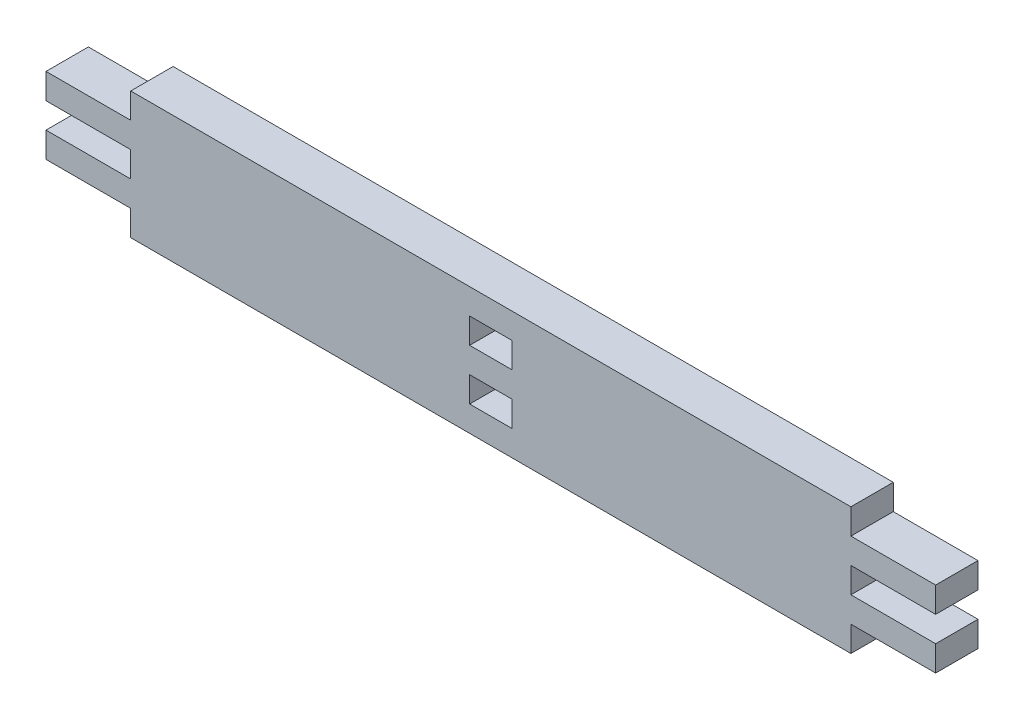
ISO-10303-21;
HEADER;
FILE_DESCRIPTION(('STEP AP214'),'2;1');
FILE_NAME('part.step','',(''),(''),'','','');
FILE_SCHEMA(('AUTOMOTIVE_DESIGN { 1 0 10303 214 1 1 1 1 }'));
ENDSEC;
DATA;
#1=APPLICATION_CONTEXT('core data for automotive mechanical design processes');
#2=APPLICATION_PROTOCOL_DEFINITION('international standard','automotive_design',2000,#1);
#3=PRODUCT_CONTEXT('',#1,'mechanical');
#4=PRODUCT('Part','Part','',(#3));
#5=PRODUCT_RELATED_PRODUCT_CATEGORY('part','',(#4));
#6=PRODUCT_DEFINITION_FORMATION('','',#4);
#7=PRODUCT_DEFINITION_CONTEXT('part definition',#1,'design');
#8=PRODUCT_DEFINITION('design','',#6,#7);
#9=PRODUCT_DEFINITION_SHAPE('','',#8);
#10=(LENGTH_UNIT() NAMED_UNIT(*) SI_UNIT(.MILLI.,.METRE.));
#11=(NAMED_UNIT(*) PLANE_ANGLE_UNIT() SI_UNIT($,.RADIAN.));
#12=(NAMED_UNIT(*) SI_UNIT($,.STERADIAN.) SOLID_ANGLE_UNIT());
#13=UNCERTAINTY_MEASURE_WITH_UNIT(LENGTH_MEASURE(1.E-05),#10,'distance_accuracy_value','');
#14=(GEOMETRIC_REPRESENTATION_CONTEXT(3) GLOBAL_UNCERTAINTY_ASSIGNED_CONTEXT((#13)) GLOBAL_UNIT_ASSIGNED_CONTEXT((#10,
#11,#12)) REPRESENTATION_CONTEXT('',''));
#15=CARTESIAN_POINT('',(0.,0.,0.));
#16=DIRECTION('',(0.,0.,1.));
#17=DIRECTION('',(1.,0.,0.));
#18=AXIS2_PLACEMENT_3D('',#15,#16,#17);
#19=CARTESIAN_POINT('',(31.5,-4.5,3.));
#20=DIRECTION('',(-1.,0.,0.));
#21=DIRECTION('',(0.,0.,1.));
#22=AXIS2_PLACEMENT_3D('',#19,#20,#21);
#23=PLANE('',#22);
#24=DIRECTION('',(0.,0.,1.));
#25=VECTOR('',#24,1.);
#26=CARTESIAN_POINT('',(31.5,-2.7,-7.));
#27=LINE('',#26,#25);
#28=CARTESIAN_POINT('',(31.5,-2.7,0.));
#29=VERTEX_POINT('',#28);
#30=CARTESIAN_POINT('',(31.5,-2.7,3.));
#31=VERTEX_POINT('',#30);
#32=EDGE_CURVE('E268',#29,#31,#27,.T.);
#33=ORIENTED_EDGE('',*,*,#32,.F.);
#34=DIRECTION('',(0.,1.,0.));
#35=VECTOR('',#34,1.);
#36=CARTESIAN_POINT('',(31.5,-4.5,0.));
#37=LINE('',#36,#35);
#38=CARTESIAN_POINT('',(31.5,-0.9,0.));
#39=VERTEX_POINT('',#38);
#40=EDGE_CURVE('E362',#29,#39,#37,.T.);
#41=ORIENTED_EDGE('',*,*,#40,.T.);
#42=DIRECTION('',(0.,0.,1.));
#43=VECTOR('',#42,1.);
#44=CARTESIAN_POINT('',(31.5,-0.9,-7.));
#45=LINE('',#44,#43);
#46=CARTESIAN_POINT('',(31.5,-0.9,3.));
#47=VERTEX_POINT('',#46);
#48=EDGE_CURVE('E285',#39,#47,#45,.T.);
#49=ORIENTED_EDGE('',*,*,#48,.T.);
#50=DIRECTION('',(0.,1.,0.));
#51=VECTOR('',#50,1.);
#52=CARTESIAN_POINT('',(31.5,-4.5,3.));
#53=LINE('',#52,#51);
#54=EDGE_CURVE('E349',#31,#47,#53,.T.);
#55=ORIENTED_EDGE('',*,*,#54,.F.);
#56=EDGE_LOOP('',(#33,#41,#49,#55));
#57=FACE_BOUND('',#56,.T.);
#58=ADVANCED_FACE('F31',(#57),#23,.F.);
#59=CARTESIAN_POINT('',(31.5,4.5,3.));
#60=DIRECTION('',(0.,0.,-1.));
#61=DIRECTION('',(-1.,0.,0.));
#62=AXIS2_PLACEMENT_3D('',#59,#60,#61);
#63=PLANE('',#62);
#64=DIRECTION('',(-1.,0.,0.));
#65=VECTOR('',#64,1.);
#66=CARTESIAN_POINT('',(1.50000000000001,-0.900000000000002,3.));
#67=LINE('',#66,#65);
#68=CARTESIAN_POINT('',(1.50000000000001,-0.900000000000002,3.));
#69=VERTEX_POINT('',#68);
#70=CARTESIAN_POINT('',(-1.49999999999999,-0.900000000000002,3.));
#71=VERTEX_POINT('',#70);
#72=EDGE_CURVE('E226',#69,#71,#67,.T.);
#73=ORIENTED_EDGE('',*,*,#72,.F.);
#74=DIRECTION('',(0.,1.,0.));
#75=VECTOR('',#74,1.);
#76=CARTESIAN_POINT('',(1.50000000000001,-0.900000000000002,3.));
#77=LINE('',#76,#75);
#78=CARTESIAN_POINT('',(1.50000000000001,-2.7,3.));
#79=VERTEX_POINT('',#78);
#80=EDGE_CURVE('E45',#79,#69,#77,.T.);
#81=ORIENTED_EDGE('',*,*,#80,.F.);
#82=DIRECTION('',(1.,0.,0.));
#83=VECTOR('',#82,1.);
#84=CARTESIAN_POINT('',(1.50000000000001,-2.7,3.));
#85=LINE('',#84,#83);
#86=CARTESIAN_POINT('',(-1.49999999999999,-2.7,3.));
#87=VERTEX_POINT('',#86);
#88=EDGE_CURVE('E233',#87,#79,#85,.T.);
#89=ORIENTED_EDGE('',*,*,#88,.F.);
#90=DIRECTION('',(0.,-1.,0.));
#91=VECTOR('',#90,1.);
#92=CARTESIAN_POINT('',(-1.49999999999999,-0.900000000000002,3.));
#93=LINE('',#92,#91);
#94=EDGE_CURVE('E217',#71,#87,#93,.T.);
#95=ORIENTED_EDGE('',*,*,#94,.F.);
#96=EDGE_LOOP('',(#73,#81,#89,#95));
#97=FACE_BOUND('',#96,.T.);
#98=DIRECTION('',(1.,0.,0.));
#99=VECTOR('',#98,1.);
#100=CARTESIAN_POINT('',(-1.49999999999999,0.899999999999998,3.));
#101=LINE('',#100,#99);
#102=CARTESIAN_POINT('',(-1.49999999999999,0.899999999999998,3.));
#103=VERTEX_POINT('',#102);
#104=CARTESIAN_POINT('',(1.50000000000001,0.899999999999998,3.));
#105=VERTEX_POINT('',#104);
#106=EDGE_CURVE('E244',#103,#105,#101,.T.);
#107=ORIENTED_EDGE('',*,*,#106,.F.);
#108=DIRECTION('',(0.,-1.,0.));
#109=VECTOR('',#108,1.);
#110=CARTESIAN_POINT('',(-1.49999999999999,2.7,3.));
#111=LINE('',#110,#109);
#112=CARTESIAN_POINT('',(-1.49999999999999,2.7,3.));
#113=VERTEX_POINT('',#112);
#114=EDGE_CURVE('E240',#113,#103,#111,.T.);
#115=ORIENTED_EDGE('',*,*,#114,.F.);
#116=DIRECTION('',(-1.,0.,0.));
#117=VECTOR('',#116,1.);
#118=CARTESIAN_POINT('',(-1.49999999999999,2.7,3.));
#119=LINE('',#118,#117);
#120=CARTESIAN_POINT('',(1.50000000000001,2.7,3.));
#121=VERTEX_POINT('',#120);
#122=EDGE_CURVE('E250',#121,#113,#119,.T.);
#123=ORIENTED_EDGE('',*,*,#122,.F.);
#124=DIRECTION('',(0.,1.,0.));
#125=VECTOR('',#124,1.);
#126=CARTESIAN_POINT('',(1.50000000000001,2.7,3.));
#127=LINE('',#126,#125);
#128=EDGE_CURVE('E247',#105,#121,#127,.T.);
#129=ORIENTED_EDGE('',*,*,#128,.F.);
#130=EDGE_LOOP('',(#107,#115,#123,#129));
#131=FACE_BOUND('',#130,.T.);
#132=DIRECTION('',(0.,1.,0.));
#133=VECTOR('',#132,1.);
#134=CARTESIAN_POINT('',(25.5,-2.7,3.));
#135=LINE('',#134,#133);
#136=CARTESIAN_POINT('',(25.5,-4.5,3.));
#137=VERTEX_POINT('',#136);
#138=CARTESIAN_POINT('',(25.5,-2.7,3.));
#139=VERTEX_POINT('',#138);
#140=EDGE_CURVE('E265',#137,#139,#135,.T.);
#141=ORIENTED_EDGE('',*,*,#140,.T.);
#142=DIRECTION('',(1.,0.,0.));
#143=VECTOR('',#142,1.);
#144=CARTESIAN_POINT('',(31.5,-2.7,3.));
#145=LINE('',#144,#143);
#146=EDGE_CURVE('E256',#139,#31,#145,.T.);
#147=ORIENTED_EDGE('',*,*,#146,.T.);
#148=ORIENTED_EDGE('',*,*,#54,.T.);
#149=DIRECTION('',(-1.,0.,0.));
#150=VECTOR('',#149,1.);
#151=CARTESIAN_POINT('',(31.5,-0.9,3.));
#152=LINE('',#151,#150);
#153=CARTESIAN_POINT('',(25.5,-0.9,3.));
#154=VERTEX_POINT('',#153);
#155=EDGE_CURVE('E281',#47,#154,#152,.T.);
#156=ORIENTED_EDGE('',*,*,#155,.T.);
#157=DIRECTION('',(0.,1.,0.));
#158=VECTOR('',#157,1.);
#159=CARTESIAN_POINT('',(25.5,0.9,3.));
#160=LINE('',#159,#158);
#161=CARTESIAN_POINT('',(25.5,0.9,3.));
#162=VERTEX_POINT('',#161);
#163=EDGE_CURVE('E278',#154,#162,#160,.T.);
#164=ORIENTED_EDGE('',*,*,#163,.T.);
#165=DIRECTION('',(1.,0.,0.));
#166=VECTOR('',#165,1.);
#167=CARTESIAN_POINT('',(31.5,0.9,3.));
#168=LINE('',#167,#166);
#169=CARTESIAN_POINT('',(31.5,0.9,3.));
#170=VERTEX_POINT('',#169);
#171=EDGE_CURVE('E275',#162,#170,#168,.T.);
#172=ORIENTED_EDGE('',*,*,#171,.T.);
#173=CARTESIAN_POINT('',(31.5,2.7,3.));
#174=VERTEX_POINT('',#173);
#175=EDGE_CURVE('E352',#170,#174,#53,.T.);
#176=ORIENTED_EDGE('',*,*,#175,.T.);
#177=DIRECTION('',(-1.,0.,0.));
#178=VECTOR('',#177,1.);
#179=CARTESIAN_POINT('',(31.5,2.7,3.));
#180=LINE('',#179,#178);
#181=CARTESIAN_POINT('',(25.5,2.7,3.));
#182=VERTEX_POINT('',#181);
#183=EDGE_CURVE('E296',#174,#182,#180,.T.);
#184=ORIENTED_EDGE('',*,*,#183,.T.);
#185=DIRECTION('',(0.,1.,0.));
#186=VECTOR('',#185,1.);
#187=CARTESIAN_POINT('',(25.5,4.5,3.));
#188=LINE('',#187,#186);
#189=CARTESIAN_POINT('',(25.5,4.5,3.));
#190=VERTEX_POINT('',#189);
#191=EDGE_CURVE('E288',#182,#190,#188,.T.);
#192=ORIENTED_EDGE('',*,*,#191,.T.);
#193=DIRECTION('',(-1.,0.,0.));
#194=VECTOR('',#193,1.);
#195=CARTESIAN_POINT('',(-31.5,4.5,3.));
#196=LINE('',#195,#194);
#197=CARTESIAN_POINT('',(-25.5,4.5,3.));
#198=VERTEX_POINT('',#197);
#199=EDGE_CURVE('E351',#190,#198,#196,.T.);
#200=ORIENTED_EDGE('',*,*,#199,.T.);
#201=DIRECTION('',(0.,1.,0.));
#202=VECTOR('',#201,1.);
#203=CARTESIAN_POINT('',(-25.5,4.5,3.));
#204=LINE('',#203,#202);
#205=CARTESIAN_POINT('',(-25.5,2.7,3.));
#206=VERTEX_POINT('',#205);
#207=EDGE_CURVE('E338',#206,#198,#204,.T.);
#208=ORIENTED_EDGE('',*,*,#207,.F.);
#209=DIRECTION('',(1.,0.,0.));
#210=VECTOR('',#209,1.);
#211=CARTESIAN_POINT('',(-31.5,2.7,3.));
#212=LINE('',#211,#210);
#213=CARTESIAN_POINT('',(-31.5,2.7,3.));
#214=VERTEX_POINT('',#213);
#215=EDGE_CURVE('E330',#214,#206,#212,.T.);
#216=ORIENTED_EDGE('',*,*,#215,.F.);
#217=DIRECTION('',(0.,-1.,0.));
#218=VECTOR('',#217,1.);
#219=CARTESIAN_POINT('',(-31.5,-4.5,3.));
#220=LINE('',#219,#218);
#221=CARTESIAN_POINT('',(-31.5,0.9,3.));
#222=VERTEX_POINT('',#221);
#223=EDGE_CURVE('E355',#214,#222,#220,.T.);
#224=ORIENTED_EDGE('',*,*,#223,.T.);
#225=DIRECTION('',(-1.,0.,0.));
#226=VECTOR('',#225,1.);
#227=CARTESIAN_POINT('',(-31.5,0.9,3.));
#228=LINE('',#227,#226);
#229=CARTESIAN_POINT('',(-25.5,0.9,3.));
#230=VERTEX_POINT('',#229);
#231=EDGE_CURVE('E324',#230,#222,#228,.T.);
#232=ORIENTED_EDGE('',*,*,#231,.F.);
#233=DIRECTION('',(0.,1.,0.));
#234=VECTOR('',#233,1.);
#235=CARTESIAN_POINT('',(-25.5,0.9,3.));
#236=LINE('',#235,#234);
#237=CARTESIAN_POINT('',(-25.5,-0.9,3.));
#238=VERTEX_POINT('',#237);
#239=EDGE_CURVE('E321',#238,#230,#236,.T.);
#240=ORIENTED_EDGE('',*,*,#239,.F.);
#241=DIRECTION('',(1.,0.,0.));
#242=VECTOR('',#241,1.);
#243=CARTESIAN_POINT('',(-31.5,-0.9,3.));
#244=LINE('',#243,#242);
#245=CARTESIAN_POINT('',(-31.5,-0.9,3.));
#246=VERTEX_POINT('',#245);
#247=EDGE_CURVE('E315',#246,#238,#244,.T.);
#248=ORIENTED_EDGE('',*,*,#247,.F.);
#249=CARTESIAN_POINT('',(-31.5,-2.7,3.));
#250=VERTEX_POINT('',#249);
#251=EDGE_CURVE('E354',#246,#250,#220,.T.);
#252=ORIENTED_EDGE('',*,*,#251,.T.);
#253=DIRECTION('',(-1.,0.,0.));
#254=VECTOR('',#253,1.);
#255=CARTESIAN_POINT('',(-31.5,-2.7,3.));
#256=LINE('',#255,#254);
#257=CARTESIAN_POINT('',(-25.5,-2.7,3.));
#258=VERTEX_POINT('',#257);
#259=EDGE_CURVE('E309',#258,#250,#256,.T.);
#260=ORIENTED_EDGE('',*,*,#259,.F.);
#261=DIRECTION('',(0.,1.,0.));
#262=VECTOR('',#261,1.);
#263=CARTESIAN_POINT('',(-25.5,-2.7,3.));
#264=LINE('',#263,#262);
#265=CARTESIAN_POINT('',(-25.5,-4.5,3.));
#266=VERTEX_POINT('',#265);
#267=EDGE_CURVE('E303',#266,#258,#264,.T.);
#268=ORIENTED_EDGE('',*,*,#267,.F.);
#269=DIRECTION('',(1.,0.,0.));
#270=VECTOR('',#269,1.);
#271=CARTESIAN_POINT('',(-31.5,-4.5,3.));
#272=LINE('',#271,#270);
#273=EDGE_CURVE('E358',#266,#137,#272,.T.);
#274=ORIENTED_EDGE('',*,*,#273,.T.);
#275=EDGE_LOOP('',(#141,#147,#148,#156,#164,#172,#176,#184,#192,#200,#208,#216,#224,#232,#240,
#248,#252,#260,#268,#274));
#276=FACE_BOUND('',#275,.T.);
#277=ADVANCED_FACE('F230',(#97,#131,#276),#63,.F.);
#278=CARTESIAN_POINT('',(31.5,4.5,0.));
#279=DIRECTION('',(0.,0.,-1.));
#280=DIRECTION('',(-1.,0.,0.));
#281=AXIS2_PLACEMENT_3D('',#278,#279,#280);
#282=PLANE('',#281);
#283=DIRECTION('',(0.,-1.,0.));
#284=VECTOR('',#283,1.);
#285=CARTESIAN_POINT('',(1.50000000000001,4.5,0.));
#286=LINE('',#285,#284);
#287=CARTESIAN_POINT('',(1.50000000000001,-0.900000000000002,0.));
#288=VERTEX_POINT('',#287);
#289=CARTESIAN_POINT('',(1.50000000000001,-2.7,0.));
#290=VERTEX_POINT('',#289);
#291=EDGE_CURVE('E11',#288,#290,#286,.T.);
#292=ORIENTED_EDGE('',*,*,#291,.F.);
#293=DIRECTION('',(1.,0.,0.));
#294=VECTOR('',#293,1.);
#295=CARTESIAN_POINT('',(31.5,-0.900000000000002,0.));
#296=LINE('',#295,#294);
#297=CARTESIAN_POINT('',(-1.49999999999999,-0.900000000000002,0.));
#298=VERTEX_POINT('',#297);
#299=EDGE_CURVE('E418',#298,#288,#296,.T.);
#300=ORIENTED_EDGE('',*,*,#299,.F.);
#301=DIRECTION('',(0.,1.,0.));
#302=VECTOR('',#301,1.);
#303=CARTESIAN_POINT('',(-1.49999999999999,4.5,0.));
#304=LINE('',#303,#302);
#305=CARTESIAN_POINT('',(-1.49999999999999,-2.7,0.));
#306=VERTEX_POINT('',#305);
#307=EDGE_CURVE('E220',#306,#298,#304,.T.);
#308=ORIENTED_EDGE('',*,*,#307,.F.);
#309=DIRECTION('',(-1.,0.,0.));
#310=VECTOR('',#309,1.);
#311=CARTESIAN_POINT('',(31.5,-2.7,0.));
#312=LINE('',#311,#310);
#313=EDGE_CURVE('E38',#290,#306,#312,.T.);
#314=ORIENTED_EDGE('',*,*,#313,.F.);
#315=EDGE_LOOP('',(#292,#300,#308,#314));
#316=FACE_BOUND('',#315,.T.);
#317=DIRECTION('',(0.,1.,0.));
#318=VECTOR('',#317,1.);
#319=CARTESIAN_POINT('',(-1.49999999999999,4.5,0.));
#320=LINE('',#319,#318);
#321=CARTESIAN_POINT('',(-1.49999999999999,0.899999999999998,0.));
#322=VERTEX_POINT('',#321);
#323=CARTESIAN_POINT('',(-1.49999999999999,2.7,0.));
#324=VERTEX_POINT('',#323);
#325=EDGE_CURVE('E416',#322,#324,#320,.T.);
#326=ORIENTED_EDGE('',*,*,#325,.F.);
#327=DIRECTION('',(-1.,0.,0.));
#328=VECTOR('',#327,1.);
#329=CARTESIAN_POINT('',(31.5,0.899999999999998,0.));
#330=LINE('',#329,#328);
#331=CARTESIAN_POINT('',(1.50000000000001,0.899999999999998,0.));
#332=VERTEX_POINT('',#331);
#333=EDGE_CURVE('E409',#332,#322,#330,.T.);
#334=ORIENTED_EDGE('',*,*,#333,.F.);
#335=DIRECTION('',(0.,-1.,0.));
#336=VECTOR('',#335,1.);
#337=CARTESIAN_POINT('',(1.50000000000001,4.5,0.));
#338=LINE('',#337,#336);
#339=CARTESIAN_POINT('',(1.50000000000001,2.7,0.));
#340=VERTEX_POINT('',#339);
#341=EDGE_CURVE('E411',#340,#332,#338,.T.);
#342=ORIENTED_EDGE('',*,*,#341,.F.);
#343=DIRECTION('',(1.,0.,0.));
#344=VECTOR('',#343,1.);
#345=CARTESIAN_POINT('',(31.5,2.7,0.));
#346=LINE('',#345,#344);
#347=EDGE_CURVE('E414',#324,#340,#346,.T.);
#348=ORIENTED_EDGE('',*,*,#347,.F.);
#349=EDGE_LOOP('',(#326,#334,#342,#348));
#350=FACE_BOUND('',#349,.T.);
#351=DIRECTION('',(-1.,0.,0.));
#352=VECTOR('',#351,1.);
#353=CARTESIAN_POINT('',(31.5,-2.7,0.));
#354=LINE('',#353,#352);
#355=CARTESIAN_POINT('',(25.5,-2.7,0.));
#356=VERTEX_POINT('',#355);
#357=EDGE_CURVE('E406',#29,#356,#354,.T.);
#358=ORIENTED_EDGE('',*,*,#357,.T.);
#359=DIRECTION('',(0.,-1.,0.));
#360=VECTOR('',#359,1.);
#361=CARTESIAN_POINT('',(25.5,4.5,0.));
#362=LINE('',#361,#360);
#363=CARTESIAN_POINT('',(25.5,-4.5,0.));
#364=VERTEX_POINT('',#363);
#365=EDGE_CURVE('E271',#356,#364,#362,.T.);
#366=ORIENTED_EDGE('',*,*,#365,.T.);
#367=DIRECTION('',(1.,0.,0.));
#368=VECTOR('',#367,1.);
#369=CARTESIAN_POINT('',(-31.5,-4.5,0.));
#370=LINE('',#369,#368);
#371=CARTESIAN_POINT('',(-25.5,-4.5,0.));
#372=VERTEX_POINT('',#371);
#373=EDGE_CURVE('E370',#372,#364,#370,.T.);
#374=ORIENTED_EDGE('',*,*,#373,.F.);
#375=DIRECTION('',(0.,-1.,0.));
#376=VECTOR('',#375,1.);
#377=CARTESIAN_POINT('',(-25.5,4.5,0.));
#378=LINE('',#377,#376);
#379=CARTESIAN_POINT('',(-25.5,-2.7,0.));
#380=VERTEX_POINT('',#379);
#381=EDGE_CURVE('E384',#380,#372,#378,.T.);
#382=ORIENTED_EDGE('',*,*,#381,.F.);
#383=DIRECTION('',(1.,0.,0.));
#384=VECTOR('',#383,1.);
#385=CARTESIAN_POINT('',(31.5,-2.7,0.));
#386=LINE('',#385,#384);
#387=CARTESIAN_POINT('',(-31.5,-2.7,0.));
#388=VERTEX_POINT('',#387);
#389=EDGE_CURVE('E386',#388,#380,#386,.T.);
#390=ORIENTED_EDGE('',*,*,#389,.F.);
#391=DIRECTION('',(0.,-1.,0.));
#392=VECTOR('',#391,1.);
#393=CARTESIAN_POINT('',(-31.5,-4.5,0.));
#394=LINE('',#393,#392);
#395=CARTESIAN_POINT('',(-31.5,-0.9,0.));
#396=VERTEX_POINT('',#395);
#397=EDGE_CURVE('E366',#396,#388,#394,.T.);
#398=ORIENTED_EDGE('',*,*,#397,.F.);
#399=DIRECTION('',(-1.,0.,0.));
#400=VECTOR('',#399,1.);
#401=CARTESIAN_POINT('',(31.5,-0.900000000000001,0.));
#402=LINE('',#401,#400);
#403=CARTESIAN_POINT('',(-25.5,-0.900000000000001,0.));
#404=VERTEX_POINT('',#403);
#405=EDGE_CURVE('E377',#404,#396,#402,.T.);
#406=ORIENTED_EDGE('',*,*,#405,.F.);
#407=DIRECTION('',(0.,-1.,0.));
#408=VECTOR('',#407,1.);
#409=CARTESIAN_POINT('',(-25.5,4.5,0.));
#410=LINE('',#409,#408);
#411=CARTESIAN_POINT('',(-25.5,0.9,0.));
#412=VERTEX_POINT('',#411);
#413=EDGE_CURVE('E379',#412,#404,#410,.T.);
#414=ORIENTED_EDGE('',*,*,#413,.F.);
#415=DIRECTION('',(1.,0.,0.));
#416=VECTOR('',#415,1.);
#417=CARTESIAN_POINT('',(31.5,0.9,0.));
#418=LINE('',#417,#416);
#419=CARTESIAN_POINT('',(-31.5,0.9,0.));
#420=VERTEX_POINT('',#419);
#421=EDGE_CURVE('E382',#420,#412,#418,.T.);
#422=ORIENTED_EDGE('',*,*,#421,.F.);
#423=CARTESIAN_POINT('',(-31.5,2.7,0.));
#424=VERTEX_POINT('',#423);
#425=EDGE_CURVE('E367',#424,#420,#394,.T.);
#426=ORIENTED_EDGE('',*,*,#425,.F.);
#427=DIRECTION('',(-1.,0.,0.));
#428=VECTOR('',#427,1.);
#429=CARTESIAN_POINT('',(31.5,2.7,0.));
#430=LINE('',#429,#428);
#431=CARTESIAN_POINT('',(-25.5,2.7,0.));
#432=VERTEX_POINT('',#431);
#433=EDGE_CURVE('E361',#432,#424,#430,.T.);
#434=ORIENTED_EDGE('',*,*,#433,.F.);
#435=DIRECTION('',(0.,-1.,0.));
#436=VECTOR('',#435,1.);
#437=CARTESIAN_POINT('',(-25.5,4.5,0.));
#438=LINE('',#437,#436);
#439=CARTESIAN_POINT('',(-25.5,4.5,0.));
#440=VERTEX_POINT('',#439);
#441=EDGE_CURVE('E374',#440,#432,#438,.T.);
#442=ORIENTED_EDGE('',*,*,#441,.F.);
#443=DIRECTION('',(-1.,0.,0.));
#444=VECTOR('',#443,1.);
#445=CARTESIAN_POINT('',(-31.5,4.5,0.));
#446=LINE('',#445,#444);
#447=CARTESIAN_POINT('',(25.5,4.5,0.));
#448=VERTEX_POINT('',#447);
#449=EDGE_CURVE('E364',#448,#440,#446,.T.);
#450=ORIENTED_EDGE('',*,*,#449,.F.);
#451=DIRECTION('',(0.,-1.,0.));
#452=VECTOR('',#451,1.);
#453=CARTESIAN_POINT('',(25.5,4.5,0.));
#454=LINE('',#453,#452);
#455=CARTESIAN_POINT('',(25.5,2.7,0.));
#456=VERTEX_POINT('',#455);
#457=EDGE_CURVE('E389',#448,#456,#454,.T.);
#458=ORIENTED_EDGE('',*,*,#457,.T.);
#459=DIRECTION('',(1.,0.,0.));
#460=VECTOR('',#459,1.);
#461=CARTESIAN_POINT('',(31.5,2.7,0.));
#462=LINE('',#461,#460);
#463=CARTESIAN_POINT('',(31.5,2.7,0.));
#464=VERTEX_POINT('',#463);
#465=EDGE_CURVE('E392',#456,#464,#462,.T.);
#466=ORIENTED_EDGE('',*,*,#465,.T.);
#467=CARTESIAN_POINT('',(31.5,0.9,0.));
#468=VERTEX_POINT('',#467);
#469=EDGE_CURVE('E345',#468,#464,#37,.T.);
#470=ORIENTED_EDGE('',*,*,#469,.F.);
#471=DIRECTION('',(-1.,0.,0.));
#472=VECTOR('',#471,1.);
#473=CARTESIAN_POINT('',(31.5,0.9,0.));
#474=LINE('',#473,#472);
#475=CARTESIAN_POINT('',(25.5,0.9,0.));
#476=VERTEX_POINT('',#475);
#477=EDGE_CURVE('E395',#468,#476,#474,.T.);
#478=ORIENTED_EDGE('',*,*,#477,.T.);
#479=DIRECTION('',(0.,-1.,0.));
#480=VECTOR('',#479,1.);
#481=CARTESIAN_POINT('',(25.5,4.5,0.));
#482=LINE('',#481,#480);
#483=CARTESIAN_POINT('',(25.5,-0.9,0.));
#484=VERTEX_POINT('',#483);
#485=EDGE_CURVE('E398',#476,#484,#482,.T.);
#486=ORIENTED_EDGE('',*,*,#485,.T.);
#487=DIRECTION('',(1.,0.,0.));
#488=VECTOR('',#487,1.);
#489=CARTESIAN_POINT('',(31.5,-0.900000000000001,0.));
#490=LINE('',#489,#488);
#491=EDGE_CURVE('E401',#484,#39,#490,.T.);
#492=ORIENTED_EDGE('',*,*,#491,.T.);
#493=ORIENTED_EDGE('',*,*,#40,.F.);
#494=EDGE_LOOP('',(#358,#366,#374,#382,#390,#398,#406,#414,#422,#426,#434,#442,#450,#458,#466,
#470,#478,#486,#492,#493));
#495=FACE_BOUND('',#494,.T.);
#496=ADVANCED_FACE('F426',(#316,#350,#495),#282,.T.);
#497=CARTESIAN_POINT('',(-31.5,-4.5,3.));
#498=DIRECTION('',(0.,1.,0.));
#499=DIRECTION('',(0.,0.,1.));
#500=AXIS2_PLACEMENT_3D('',#497,#498,#499);
#501=PLANE('',#500);
#502=DIRECTION('',(0.,0.,-1.));
#503=VECTOR('',#502,1.);
#504=CARTESIAN_POINT('',(25.5,-4.5,3.));
#505=LINE('',#504,#503);
#506=EDGE_CURVE('E404',#137,#364,#505,.T.);
#507=ORIENTED_EDGE('',*,*,#506,.F.);
#508=ORIENTED_EDGE('',*,*,#273,.F.);
#509=DIRECTION('',(0.,0.,1.));
#510=VECTOR('',#509,1.);
#511=CARTESIAN_POINT('',(-25.5,-4.5,-7.));
#512=LINE('',#511,#510);
#513=EDGE_CURVE('E311',#372,#266,#512,.T.);
#514=ORIENTED_EDGE('',*,*,#513,.F.);
#515=ORIENTED_EDGE('',*,*,#373,.T.);
#516=EDGE_LOOP('',(#507,#508,#514,#515));
#517=FACE_BOUND('',#516,.T.);
#518=ADVANCED_FACE('F454',(#517),#501,.F.);
#519=DIRECTION('',(0.,0.,1.));
#520=VECTOR('',#519,1.);
#521=CARTESIAN_POINT('',(31.5,0.9,-7.));
#522=LINE('',#521,#520);
#523=EDGE_CURVE('E284',#468,#170,#522,.T.);
#524=ORIENTED_EDGE('',*,*,#523,.F.);
#525=ORIENTED_EDGE('',*,*,#469,.T.);
#526=DIRECTION('',(0.,0.,1.));
#527=VECTOR('',#526,1.);
#528=CARTESIAN_POINT('',(31.5,2.7,-7.));
#529=LINE('',#528,#527);
#530=EDGE_CURVE('E300',#464,#174,#529,.T.);
#531=ORIENTED_EDGE('',*,*,#530,.T.);
#532=ORIENTED_EDGE('',*,*,#175,.F.);
#533=EDGE_LOOP('',(#524,#525,#531,#532));
#534=FACE_BOUND('',#533,.T.);
#535=ADVANCED_FACE('F444',(#534),#23,.F.);
#536=CARTESIAN_POINT('',(-31.5,4.5,3.));
#537=DIRECTION('',(0.,-1.,0.));
#538=DIRECTION('',(0.,0.,-1.));
#539=AXIS2_PLACEMENT_3D('',#536,#537,#538);
#540=PLANE('',#539);
#541=DIRECTION('',(0.,0.,1.));
#542=VECTOR('',#541,1.);
#543=CARTESIAN_POINT('',(25.5,4.5,-7.));
#544=LINE('',#543,#542);
#545=EDGE_CURVE('E299',#448,#190,#544,.T.);
#546=ORIENTED_EDGE('',*,*,#545,.F.);
#547=ORIENTED_EDGE('',*,*,#449,.T.);
#548=DIRECTION('',(0.,0.,1.));
#549=VECTOR('',#548,1.);
#550=CARTESIAN_POINT('',(-25.5,4.5,-7.));
#551=LINE('',#550,#549);
#552=EDGE_CURVE('E342',#440,#198,#551,.T.);
#553=ORIENTED_EDGE('',*,*,#552,.T.);
#554=ORIENTED_EDGE('',*,*,#199,.F.);
#555=EDGE_LOOP('',(#546,#547,#553,#554));
#556=FACE_BOUND('',#555,.T.);
#557=ADVANCED_FACE('F453',(#556),#540,.F.);
#558=CARTESIAN_POINT('',(-31.5,-4.5,3.));
#559=DIRECTION('',(1.,0.,0.));
#560=DIRECTION('',(0.,0.,-1.));
#561=AXIS2_PLACEMENT_3D('',#558,#559,#560);
#562=PLANE('',#561);
#563=ORIENTED_EDGE('',*,*,#425,.T.);
#564=DIRECTION('',(0.,0.,1.));
#565=VECTOR('',#564,1.);
#566=CARTESIAN_POINT('',(-31.5,0.9,-7.));
#567=LINE('',#566,#565);
#568=EDGE_CURVE('E327',#420,#222,#567,.T.);
#569=ORIENTED_EDGE('',*,*,#568,.T.);
#570=ORIENTED_EDGE('',*,*,#223,.F.);
#571=DIRECTION('',(0.,0.,1.));
#572=VECTOR('',#571,1.);
#573=CARTESIAN_POINT('',(-31.5,2.7,-7.));
#574=LINE('',#573,#572);
#575=EDGE_CURVE('E341',#424,#214,#574,.T.);
#576=ORIENTED_EDGE('',*,*,#575,.F.);
#577=EDGE_LOOP('',(#563,#569,#570,#576));
#578=FACE_BOUND('',#577,.T.);
#579=ADVANCED_FACE('F459',(#578),#562,.F.);
#580=ORIENTED_EDGE('',*,*,#397,.T.);
#581=DIRECTION('',(0.,0.,1.));
#582=VECTOR('',#581,1.);
#583=CARTESIAN_POINT('',(-31.5,-2.7,-7.));
#584=LINE('',#583,#582);
#585=EDGE_CURVE('E312',#388,#250,#584,.T.);
#586=ORIENTED_EDGE('',*,*,#585,.T.);
#587=ORIENTED_EDGE('',*,*,#251,.F.);
#588=DIRECTION('',(0.,0.,1.));
#589=VECTOR('',#588,1.);
#590=CARTESIAN_POINT('',(-31.5,-0.9,-7.));
#591=LINE('',#590,#589);
#592=EDGE_CURVE('E326',#396,#246,#591,.T.);
#593=ORIENTED_EDGE('',*,*,#592,.F.);
#594=EDGE_LOOP('',(#580,#586,#587,#593));
#595=FACE_BOUND('',#594,.T.);
#596=ADVANCED_FACE('F513',(#595),#562,.F.);
#597=CARTESIAN_POINT('',(-25.5,4.5,-7.));
#598=DIRECTION('',(1.,0.,0.));
#599=DIRECTION('',(0.,0.,-1.));
#600=AXIS2_PLACEMENT_3D('',#597,#598,#599);
#601=PLANE('',#600);
#602=ORIENTED_EDGE('',*,*,#441,.T.);
#603=DIRECTION('',(0.,0.,1.));
#604=VECTOR('',#603,1.);
#605=CARTESIAN_POINT('',(-25.5,2.7,-7.));
#606=LINE('',#605,#604);
#607=EDGE_CURVE('E346',#432,#206,#606,.T.);
#608=ORIENTED_EDGE('',*,*,#607,.T.);
#609=ORIENTED_EDGE('',*,*,#207,.T.);
#610=ORIENTED_EDGE('',*,*,#552,.F.);
#611=EDGE_LOOP('',(#602,#608,#609,#610));
#612=FACE_BOUND('',#611,.T.);
#613=ADVANCED_FACE('F540',(#612),#601,.F.);
#614=CARTESIAN_POINT('',(-31.5,2.7,-7.));
#615=DIRECTION('',(0.,-1.,0.));
#616=DIRECTION('',(0.,0.,-1.));
#617=AXIS2_PLACEMENT_3D('',#614,#615,#616);
#618=PLANE('',#617);
#619=ORIENTED_EDGE('',*,*,#433,.T.);
#620=ORIENTED_EDGE('',*,*,#575,.T.);
#621=ORIENTED_EDGE('',*,*,#215,.T.);
#622=ORIENTED_EDGE('',*,*,#607,.F.);
#623=EDGE_LOOP('',(#619,#620,#621,#622));
#624=FACE_BOUND('',#623,.T.);
#625=ADVANCED_FACE('F535',(#624),#618,.F.);
#626=CARTESIAN_POINT('',(-31.5,0.9,-7.));
#627=DIRECTION('',(0.,1.,0.));
#628=DIRECTION('',(0.,0.,1.));
#629=AXIS2_PLACEMENT_3D('',#626,#627,#628);
#630=PLANE('',#629);
#631=ORIENTED_EDGE('',*,*,#421,.T.);
#632=DIRECTION('',(0.,0.,1.));
#633=VECTOR('',#632,1.);
#634=CARTESIAN_POINT('',(-25.5,0.9,-7.));
#635=LINE('',#634,#633);
#636=EDGE_CURVE('E331',#412,#230,#635,.T.);
#637=ORIENTED_EDGE('',*,*,#636,.T.);
#638=ORIENTED_EDGE('',*,*,#231,.T.);
#639=ORIENTED_EDGE('',*,*,#568,.F.);
#640=EDGE_LOOP('',(#631,#637,#638,#639));
#641=FACE_BOUND('',#640,.T.);
#642=ADVANCED_FACE('F528',(#641),#630,.F.);
#643=CARTESIAN_POINT('',(-25.5,0.9,-7.));
#644=DIRECTION('',(1.,0.,0.));
#645=DIRECTION('',(0.,0.,-1.));
#646=AXIS2_PLACEMENT_3D('',#643,#644,#645);
#647=PLANE('',#646);
#648=ORIENTED_EDGE('',*,*,#413,.T.);
#649=DIRECTION('',(0.,0.,1.));
#650=VECTOR('',#649,1.);
#651=CARTESIAN_POINT('',(-25.5,-0.9,-7.));
#652=LINE('',#651,#650);
#653=EDGE_CURVE('E333',#404,#238,#652,.T.);
#654=ORIENTED_EDGE('',*,*,#653,.T.);
#655=ORIENTED_EDGE('',*,*,#239,.T.);
#656=ORIENTED_EDGE('',*,*,#636,.F.);
#657=EDGE_LOOP('',(#648,#654,#655,#656));
#658=FACE_BOUND('',#657,.T.);
#659=ADVANCED_FACE('F526',(#658),#647,.F.);
#660=CARTESIAN_POINT('',(-31.5,-0.9,-7.));
#661=DIRECTION('',(0.,-1.,0.));
#662=DIRECTION('',(0.,0.,-1.));
#663=AXIS2_PLACEMENT_3D('',#660,#661,#662);
#664=PLANE('',#663);
#665=ORIENTED_EDGE('',*,*,#405,.T.);
#666=ORIENTED_EDGE('',*,*,#592,.T.);
#667=ORIENTED_EDGE('',*,*,#247,.T.);
#668=ORIENTED_EDGE('',*,*,#653,.F.);
#669=EDGE_LOOP('',(#665,#666,#667,#668));
#670=FACE_BOUND('',#669,.T.);
#671=ADVANCED_FACE('F519',(#670),#664,.F.);
#672=CARTESIAN_POINT('',(-31.5,-2.7,-7.));
#673=DIRECTION('',(0.,1.,0.));
#674=DIRECTION('',(0.,0.,1.));
#675=AXIS2_PLACEMENT_3D('',#672,#673,#674);
#676=PLANE('',#675);
#677=ORIENTED_EDGE('',*,*,#389,.T.);
#678=DIRECTION('',(0.,0.,1.));
#679=VECTOR('',#678,1.);
#680=CARTESIAN_POINT('',(-25.5,-2.7,-7.));
#681=LINE('',#680,#679);
#682=EDGE_CURVE('E316',#380,#258,#681,.T.);
#683=ORIENTED_EDGE('',*,*,#682,.T.);
#684=ORIENTED_EDGE('',*,*,#259,.T.);
#685=ORIENTED_EDGE('',*,*,#585,.F.);
#686=EDGE_LOOP('',(#677,#683,#684,#685));
#687=FACE_BOUND('',#686,.T.);
#688=ADVANCED_FACE('F509',(#687),#676,.F.);
#689=CARTESIAN_POINT('',(-25.5,-2.7,-7.));
#690=DIRECTION('',(1.,0.,0.));
#691=DIRECTION('',(0.,0.,-1.));
#692=AXIS2_PLACEMENT_3D('',#689,#690,#691);
#693=PLANE('',#692);
#694=ORIENTED_EDGE('',*,*,#381,.T.);
#695=ORIENTED_EDGE('',*,*,#513,.T.);
#696=ORIENTED_EDGE('',*,*,#267,.T.);
#697=ORIENTED_EDGE('',*,*,#682,.F.);
#698=EDGE_LOOP('',(#694,#695,#696,#697));
#699=FACE_BOUND('',#698,.T.);
#700=ADVANCED_FACE('F506',(#699),#693,.F.);
#701=CARTESIAN_POINT('',(31.5,2.7,-7.));
#702=DIRECTION('',(0.,1.,0.));
#703=DIRECTION('',(0.,0.,1.));
#704=AXIS2_PLACEMENT_3D('',#701,#702,#703);
#705=PLANE('',#704);
#706=DIRECTION('',(0.,0.,1.));
#707=VECTOR('',#706,1.);
#708=CARTESIAN_POINT('',(25.5,2.7,-7.));
#709=LINE('',#708,#707);
#710=EDGE_CURVE('E304',#456,#182,#709,.T.);
#711=ORIENTED_EDGE('',*,*,#710,.T.);
#712=ORIENTED_EDGE('',*,*,#183,.F.);
#713=ORIENTED_EDGE('',*,*,#530,.F.);
#714=ORIENTED_EDGE('',*,*,#465,.F.);
#715=EDGE_LOOP('',(#711,#712,#713,#714));
#716=FACE_BOUND('',#715,.T.);
#717=ADVANCED_FACE('F473',(#716),#705,.T.);
#718=CARTESIAN_POINT('',(25.5,4.5,-7.));
#719=DIRECTION('',(1.,0.,0.));
#720=DIRECTION('',(0.,0.,-1.));
#721=AXIS2_PLACEMENT_3D('',#718,#719,#720);
#722=PLANE('',#721);
#723=ORIENTED_EDGE('',*,*,#545,.T.);
#724=ORIENTED_EDGE('',*,*,#191,.F.);
#725=ORIENTED_EDGE('',*,*,#710,.F.);
#726=ORIENTED_EDGE('',*,*,#457,.F.);
#727=EDGE_LOOP('',(#723,#724,#725,#726));
#728=FACE_BOUND('',#727,.T.);
#729=ADVANCED_FACE('F543',(#728),#722,.T.);
#730=CARTESIAN_POINT('',(31.5,-0.9,-7.));
#731=DIRECTION('',(0.,1.,0.));
#732=DIRECTION('',(0.,0.,1.));
#733=AXIS2_PLACEMENT_3D('',#730,#731,#732);
#734=PLANE('',#733);
#735=DIRECTION('',(0.,0.,1.));
#736=VECTOR('',#735,1.);
#737=CARTESIAN_POINT('',(25.5,-0.9,-7.));
#738=LINE('',#737,#736);
#739=EDGE_CURVE('E289',#484,#154,#738,.T.);
#740=ORIENTED_EDGE('',*,*,#739,.T.);
#741=ORIENTED_EDGE('',*,*,#155,.F.);
#742=ORIENTED_EDGE('',*,*,#48,.F.);
#743=ORIENTED_EDGE('',*,*,#491,.F.);
#744=EDGE_LOOP('',(#740,#741,#742,#743));
#745=FACE_BOUND('',#744,.T.);
#746=ADVANCED_FACE('F487',(#745),#734,.T.);
#747=CARTESIAN_POINT('',(25.5,0.9,-7.));
#748=DIRECTION('',(1.,0.,0.));
#749=DIRECTION('',(0.,0.,-1.));
#750=AXIS2_PLACEMENT_3D('',#747,#748,#749);
#751=PLANE('',#750);
#752=DIRECTION('',(0.,0.,1.));
#753=VECTOR('',#752,1.);
#754=CARTESIAN_POINT('',(25.5,0.9,-7.));
#755=LINE('',#754,#753);
#756=EDGE_CURVE('E291',#476,#162,#755,.T.);
#757=ORIENTED_EDGE('',*,*,#756,.T.);
#758=ORIENTED_EDGE('',*,*,#163,.F.);
#759=ORIENTED_EDGE('',*,*,#739,.F.);
#760=ORIENTED_EDGE('',*,*,#485,.F.);
#761=EDGE_LOOP('',(#757,#758,#759,#760));
#762=FACE_BOUND('',#761,.T.);
#763=ADVANCED_FACE('F483',(#762),#751,.T.);
#764=CARTESIAN_POINT('',(31.5,0.9,-7.));
#765=DIRECTION('',(0.,-1.,0.));
#766=DIRECTION('',(0.,0.,-1.));
#767=AXIS2_PLACEMENT_3D('',#764,#765,#766);
#768=PLANE('',#767);
#769=ORIENTED_EDGE('',*,*,#523,.T.);
#770=ORIENTED_EDGE('',*,*,#171,.F.);
#771=ORIENTED_EDGE('',*,*,#756,.F.);
#772=ORIENTED_EDGE('',*,*,#477,.F.);
#773=EDGE_LOOP('',(#769,#770,#771,#772));
#774=FACE_BOUND('',#773,.T.);
#775=ADVANCED_FACE('F479',(#774),#768,.T.);
#776=CARTESIAN_POINT('',(25.5,-2.7,-7.));
#777=DIRECTION('',(1.,0.,0.));
#778=DIRECTION('',(0.,0.,-1.));
#779=AXIS2_PLACEMENT_3D('',#776,#777,#778);
#780=PLANE('',#779);
#781=DIRECTION('',(0.,0.,1.));
#782=VECTOR('',#781,1.);
#783=CARTESIAN_POINT('',(25.5,-2.7,-7.));
#784=LINE('',#783,#782);
#785=EDGE_CURVE('E269',#356,#139,#784,.T.);
#786=ORIENTED_EDGE('',*,*,#785,.T.);
#787=ORIENTED_EDGE('',*,*,#140,.F.);
#788=ORIENTED_EDGE('',*,*,#506,.T.);
#789=ORIENTED_EDGE('',*,*,#365,.F.);
#790=EDGE_LOOP('',(#786,#787,#788,#789));
#791=FACE_BOUND('',#790,.T.);
#792=ADVANCED_FACE('F498',(#791),#780,.T.);
#793=CARTESIAN_POINT('',(31.5,-2.7,-7.));
#794=DIRECTION('',(0.,-1.,0.));
#795=DIRECTION('',(0.,0.,-1.));
#796=AXIS2_PLACEMENT_3D('',#793,#794,#795);
#797=PLANE('',#796);
#798=ORIENTED_EDGE('',*,*,#32,.T.);
#799=ORIENTED_EDGE('',*,*,#146,.F.);
#800=ORIENTED_EDGE('',*,*,#785,.F.);
#801=ORIENTED_EDGE('',*,*,#357,.F.);
#802=EDGE_LOOP('',(#798,#799,#800,#801));
#803=FACE_BOUND('',#802,.T.);
#804=ADVANCED_FACE('F492',(#803),#797,.T.);
#805=CARTESIAN_POINT('',(-1.49999999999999,2.7,-7.));
#806=DIRECTION('',(-1.,0.,0.));
#807=DIRECTION('',(0.,0.,1.));
#808=AXIS2_PLACEMENT_3D('',#805,#806,#807);
#809=PLANE('',#808);
#810=ORIENTED_EDGE('',*,*,#325,.T.);
#811=DIRECTION('',(0.,0.,1.));
#812=VECTOR('',#811,1.);
#813=CARTESIAN_POINT('',(-1.49999999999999,2.7,-7.));
#814=LINE('',#813,#812);
#815=EDGE_CURVE('E254',#324,#113,#814,.T.);
#816=ORIENTED_EDGE('',*,*,#815,.T.);
#817=ORIENTED_EDGE('',*,*,#114,.T.);
#818=DIRECTION('',(0.,0.,1.));
#819=VECTOR('',#818,1.);
#820=CARTESIAN_POINT('',(-1.49999999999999,0.899999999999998,-7.));
#821=LINE('',#820,#819);
#822=EDGE_CURVE('E253',#322,#103,#821,.T.);
#823=ORIENTED_EDGE('',*,*,#822,.F.);
#824=EDGE_LOOP('',(#810,#816,#817,#823));
#825=FACE_BOUND('',#824,.T.);
#826=ADVANCED_FACE('F690',(#825),#809,.F.);
#827=CARTESIAN_POINT('',(-1.49999999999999,2.7,-7.));
#828=DIRECTION('',(0.,1.,0.));
#829=DIRECTION('',(0.,0.,1.));
#830=AXIS2_PLACEMENT_3D('',#827,#828,#829);
#831=PLANE('',#830);
#832=ORIENTED_EDGE('',*,*,#347,.T.);
#833=DIRECTION('',(0.,0.,1.));
#834=VECTOR('',#833,1.);
#835=CARTESIAN_POINT('',(1.50000000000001,2.7,-7.));
#836=LINE('',#835,#834);
#837=EDGE_CURVE('E257',#340,#121,#836,.T.);
#838=ORIENTED_EDGE('',*,*,#837,.T.);
#839=ORIENTED_EDGE('',*,*,#122,.T.);
#840=ORIENTED_EDGE('',*,*,#815,.F.);
#841=EDGE_LOOP('',(#832,#838,#839,#840));
#842=FACE_BOUND('',#841,.T.);
#843=ADVANCED_FACE('F697',(#842),#831,.F.);
#844=CARTESIAN_POINT('',(1.50000000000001,2.7,-7.));
#845=DIRECTION('',(1.,0.,0.));
#846=DIRECTION('',(0.,0.,-1.));
#847=AXIS2_PLACEMENT_3D('',#844,#845,#846);
#848=PLANE('',#847);
#849=ORIENTED_EDGE('',*,*,#341,.T.);
#850=DIRECTION('',(0.,0.,1.));
#851=VECTOR('',#850,1.);
#852=CARTESIAN_POINT('',(1.50000000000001,0.899999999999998,-7.));
#853=LINE('',#852,#851);
#854=EDGE_CURVE('E259',#332,#105,#853,.T.);
#855=ORIENTED_EDGE('',*,*,#854,.T.);
#856=ORIENTED_EDGE('',*,*,#128,.T.);
#857=ORIENTED_EDGE('',*,*,#837,.F.);
#858=EDGE_LOOP('',(#849,#855,#856,#857));
#859=FACE_BOUND('',#858,.T.);
#860=ADVANCED_FACE('F437',(#859),#848,.F.);
#861=CARTESIAN_POINT('',(-1.49999999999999,0.899999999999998,-7.));
#862=DIRECTION('',(0.,-1.,0.));
#863=DIRECTION('',(0.,0.,-1.));
#864=AXIS2_PLACEMENT_3D('',#861,#862,#863);
#865=PLANE('',#864);
#866=ORIENTED_EDGE('',*,*,#333,.T.);
#867=ORIENTED_EDGE('',*,*,#822,.T.);
#868=ORIENTED_EDGE('',*,*,#106,.T.);
#869=ORIENTED_EDGE('',*,*,#854,.F.);
#870=EDGE_LOOP('',(#866,#867,#868,#869));
#871=FACE_BOUND('',#870,.T.);
#872=ADVANCED_FACE('F430',(#871),#865,.F.);
#873=CARTESIAN_POINT('',(1.50000000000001,-0.900000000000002,-7.));
#874=DIRECTION('',(1.,0.,0.));
#875=DIRECTION('',(0.,0.,-1.));
#876=AXIS2_PLACEMENT_3D('',#873,#874,#875);
#877=PLANE('',#876);
#878=ORIENTED_EDGE('',*,*,#291,.T.);
#879=DIRECTION('',(0.,0.,1.));
#880=VECTOR('',#879,1.);
#881=CARTESIAN_POINT('',(1.50000000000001,-2.7,-7.));
#882=LINE('',#881,#880);
#883=EDGE_CURVE('E238',#290,#79,#882,.T.);
#884=ORIENTED_EDGE('',*,*,#883,.T.);
#885=ORIENTED_EDGE('',*,*,#80,.T.);
#886=DIRECTION('',(0.,0.,1.));
#887=VECTOR('',#886,1.);
#888=CARTESIAN_POINT('',(1.50000000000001,-0.900000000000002,-7.));
#889=LINE('',#888,#887);
#890=EDGE_CURVE('E223',#288,#69,#889,.T.);
#891=ORIENTED_EDGE('',*,*,#890,.F.);
#892=EDGE_LOOP('',(#878,#884,#885,#891));
#893=FACE_BOUND('',#892,.T.);
#894=ADVANCED_FACE('F428',(#893),#877,.F.);
#895=CARTESIAN_POINT('',(1.50000000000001,-2.7,-7.));
#896=DIRECTION('',(0.,-1.,0.));
#897=DIRECTION('',(0.,0.,-1.));
#898=AXIS2_PLACEMENT_3D('',#895,#896,#897);
#899=PLANE('',#898);
#900=ORIENTED_EDGE('',*,*,#313,.T.);
#901=DIRECTION('',(0.,0.,1.));
#902=VECTOR('',#901,1.);
#903=CARTESIAN_POINT('',(-1.49999999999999,-2.7,-7.));
#904=LINE('',#903,#902);
#905=EDGE_CURVE('E222',#306,#87,#904,.T.);
#906=ORIENTED_EDGE('',*,*,#905,.T.);
#907=ORIENTED_EDGE('',*,*,#88,.T.);
#908=ORIENTED_EDGE('',*,*,#883,.F.);
#909=EDGE_LOOP('',(#900,#906,#907,#908));
#910=FACE_BOUND('',#909,.T.);
#911=ADVANCED_FACE('F423',(#910),#899,.F.);
#912=CARTESIAN_POINT('',(-1.49999999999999,-0.900000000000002,-7.));
#913=DIRECTION('',(-1.,0.,0.));
#914=DIRECTION('',(0.,0.,1.));
#915=AXIS2_PLACEMENT_3D('',#912,#913,#914);
#916=PLANE('',#915);
#917=ORIENTED_EDGE('',*,*,#307,.T.);
#918=DIRECTION('',(0.,0.,1.));
#919=VECTOR('',#918,1.);
#920=CARTESIAN_POINT('',(-1.49999999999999,-0.900000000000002,-7.));
#921=LINE('',#920,#919);
#922=EDGE_CURVE('E53',#298,#71,#921,.T.);
#923=ORIENTED_EDGE('',*,*,#922,.T.);
#924=ORIENTED_EDGE('',*,*,#94,.T.);
#925=ORIENTED_EDGE('',*,*,#905,.F.);
#926=EDGE_LOOP('',(#917,#923,#924,#925));
#927=FACE_BOUND('',#926,.T.);
#928=ADVANCED_FACE('F214',(#927),#916,.F.);
#929=CARTESIAN_POINT('',(1.50000000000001,-0.900000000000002,-7.));
#930=DIRECTION('',(0.,1.,0.));
#931=DIRECTION('',(0.,0.,1.));
#932=AXIS2_PLACEMENT_3D('',#929,#930,#931);
#933=PLANE('',#932);
#934=ORIENTED_EDGE('',*,*,#299,.T.);
#935=ORIENTED_EDGE('',*,*,#890,.T.);
#936=ORIENTED_EDGE('',*,*,#72,.T.);
#937=ORIENTED_EDGE('',*,*,#922,.F.);
#938=EDGE_LOOP('',(#934,#935,#936,#937));
#939=FACE_BOUND('',#938,.T.);
#940=ADVANCED_FACE('F227',(#939),#933,.F.);
#941=CLOSED_SHELL('',(#58,#277,#496,#518,#535,#557,#579,#596,#613,#625,#642,#659,#671,#688,#700,
#717,#729,#746,#763,#775,#792,#804,#826,#843,#860,#872,#894,#911,#928,#940));
#942=MANIFOLD_SOLID_BREP('B2',#941);
#943=ADVANCED_BREP_SHAPE_REPRESENTATION('',(#18,#942),#14);
#944=SHAPE_DEFINITION_REPRESENTATION(#9,#943);
ENDSEC;
END-ISO-10303-21;
